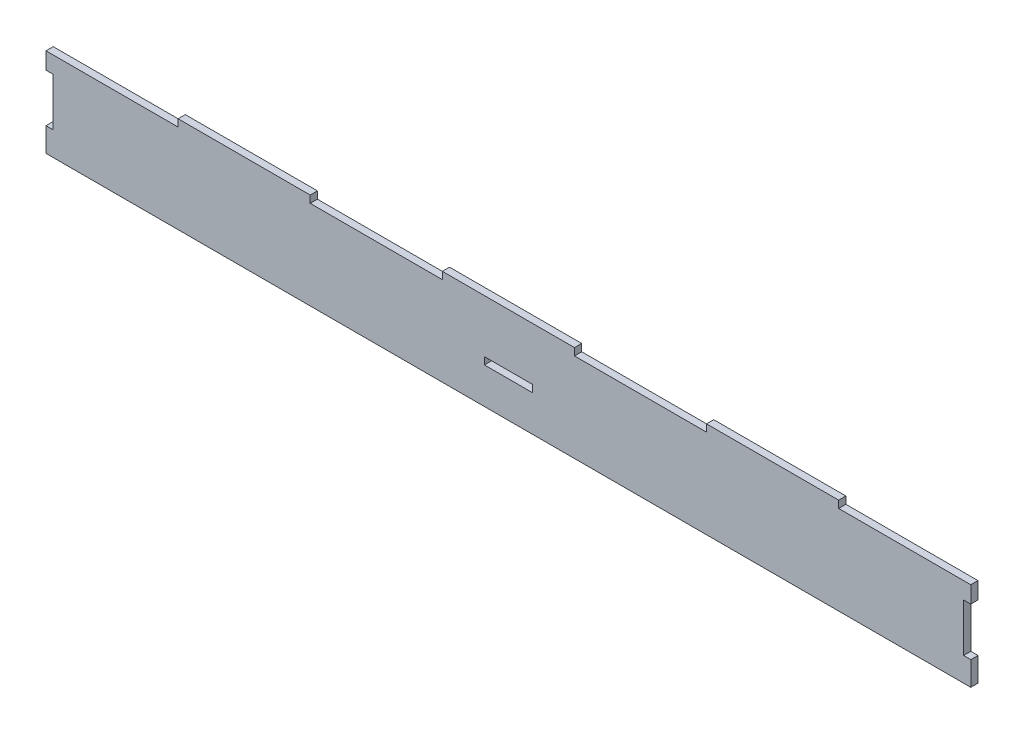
from build123d import *

# Parameters (mm, degrees)
ESQUISSE1_W             = 385
ESQUISSE1_H             = 40
BOSS_EXTRU_1_DEPTH      = 3
ESQUISSE2_W             = 55
ESQUISSE2_H             = 3
ESQUISSE2_W_2           = 3
ESQUISSE2_H_2           = 20
ESQUISSE2_W_3           = 20
ENL_V_MAT_EXTRU_1_DEPTH = 194.5594224


with BuildPart() as part:
    # Esquisse1 → Boss.-Extru.1 (new body)
    with BuildSketch(Plane.XY):
        Rectangle(ESQUISSE1_W, ESQUISSE1_H)
    extrude(amount=BOSS_EXTRU_1_DEPTH)

    # Esquisse2 → Enl_v. mat.-Extru.1 (cut, through all)
    with BuildSketch(Plane.XY.offset(3)):
        with Locations((-55, 18.5)):
            Rectangle(ESQUISSE2_W, ESQUISSE2_H)
        with Locations((-165, 18.5)):
            Rectangle(ESQUISSE2_W, ESQUISSE2_H)
        with Locations((55, 18.5)):
            Rectangle(ESQUISSE2_W, ESQUISSE2_H)
        with Locations((165, 18.5)):
            Rectangle(ESQUISSE2_W, ESQUISSE2_H)
        with Locations((-191, 0)):
            Rectangle(ESQUISSE2_W_2, ESQUISSE2_H_2)
        with Locations((191, 0)):
            Rectangle(ESQUISSE2_W_2, ESQUISSE2_H_2)
        with Locations((0, -3.5)):
            Rectangle(ESQUISSE2_W_3, ESQUISSE2_H)
    extrude(amount=-ENL_V_MAT_EXTRU_1_DEPTH, mode=Mode.SUBTRACT)


solid = part.part
